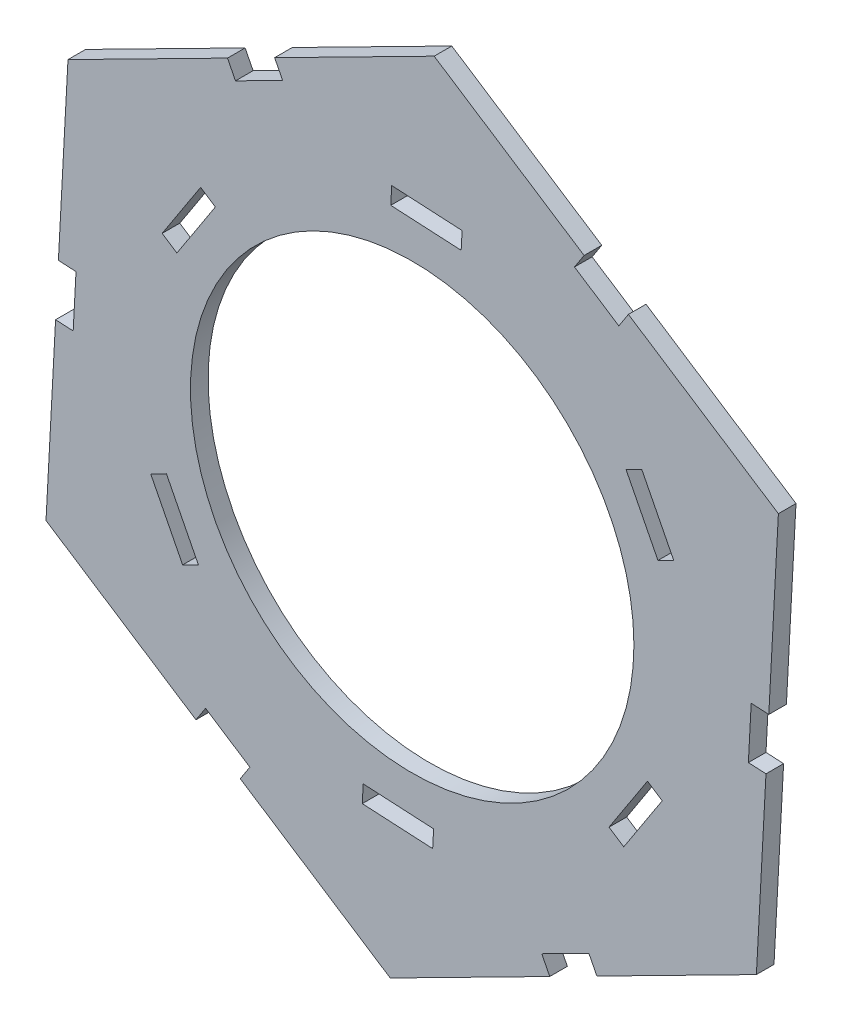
from build123d import *

# Parameters (mm, degrees)
BOSS_EXTRUDE1_DEPTH = 1.524
SKETCH2_R           = 19.172543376
CUT_EXTRUDE1_DEPTH  = 1.524


with BuildPart() as part:
    # Sketch1 → Boss-Extrude1 (new body)
    with BuildSketch(Plane.XY):
        Polygon((72.558712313, 22.577970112), (58.765102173, 15.570028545), (57.937352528, 0.12044097), (59.459169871, 0.038905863), (59.214564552, -4.526546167), (57.692747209, -4.44501106), (56.864997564, -19.894598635), (69.830858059, -28.336244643), (70.662378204, -27.059079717), (74.493872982, -29.553640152), (73.662352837, -30.830805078), (86.628213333, -39.272451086), (100.421823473, -32.264509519), (99.731526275, -30.905809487), (103.807626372, -28.834917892), (104.49792357, -30.193617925), (118.291533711, -23.185676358), (119.119283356, -7.736088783), (117.597466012, -7.654553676), (117.842071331, -3.089101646), (119.363888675, -3.170636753), (120.19163832, 12.278950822), (107.225777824, 20.72059683), (106.394257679, 19.443431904), (102.562762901, 21.937992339), (103.394283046, 23.215157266), (90.428422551, 31.656803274), (76.63481241, 24.648861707), (77.325109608, 23.290161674), (73.249009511, 21.219270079), align=None)
        Polygon((92.762623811, 18.286025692), (86.675328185, 18.611675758), (86.756740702, 20.133499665), (92.844036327, 19.807849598), align=None, mode=Mode.SUBTRACT)
        Polygon((109.779305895, 3.572084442), (107.017679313, 9.006662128), (108.376323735, 9.697068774), (111.137950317, 4.262491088), align=None, mode=Mode.SUBTRACT)
        Polygon((105.545000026, -18.521765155), (108.87066907, -13.412837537), (110.147900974, -14.244254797), (106.822231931, -19.353182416), align=None, mode=Mode.SUBTRACT)
        Polygon((84.294012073, -25.901673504), (90.381307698, -26.227323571), (90.299895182, -27.749147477), (84.212599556, -27.423497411), align=None, mode=Mode.SUBTRACT)
        Polygon((67.277329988, -11.187732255), (70.03895657, -16.622309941), (68.680312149, -17.312716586), (65.918685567, -11.878138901), align=None, mode=Mode.SUBTRACT)
        Polygon((71.511635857, 10.906117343), (68.185966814, 5.797189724), (66.908734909, 6.628606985), (70.234403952, 11.737534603), align=None, mode=Mode.SUBTRACT)
    extrude(amount=BOSS_EXTRUDE1_DEPTH)

    # Sketch2 → Cut-Extrude1 (cut)
    with BuildSketch(Plane.XY.offset(1.524)):
        with Locations((88.528317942, -3.807823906)):
            Circle(SKETCH2_R)
    extrude(amount=-CUT_EXTRUDE1_DEPTH, mode=Mode.SUBTRACT)


solid = part.part
